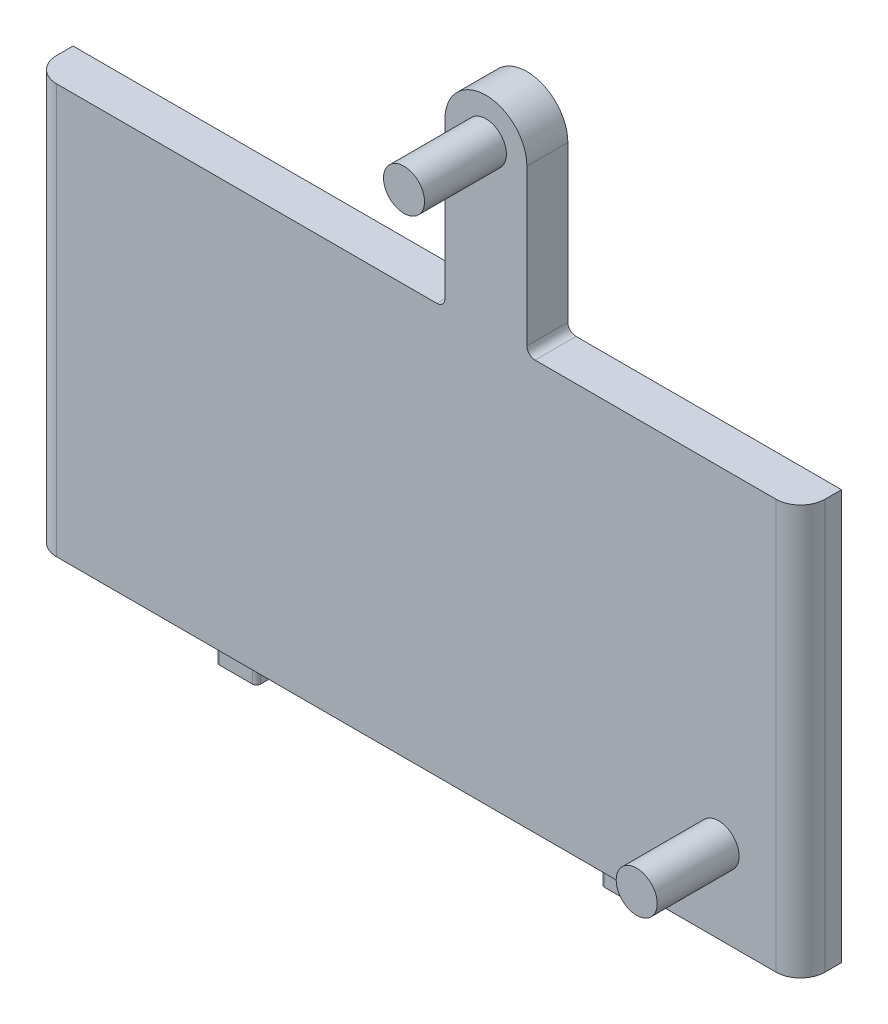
ISO-10303-21;
HEADER;
FILE_DESCRIPTION(('STEP AP214'),'2;1');
FILE_NAME('part.step','',(''),(''),'','','');
FILE_SCHEMA(('AUTOMOTIVE_DESIGN { 1 0 10303 214 1 1 1 1 }'));
ENDSEC;
DATA;
#1=APPLICATION_CONTEXT('core data for automotive mechanical design processes');
#2=APPLICATION_PROTOCOL_DEFINITION('international standard','automotive_design',2000,#1);
#3=PRODUCT_CONTEXT('',#1,'mechanical');
#4=PRODUCT('Part','Part','',(#3));
#5=PRODUCT_RELATED_PRODUCT_CATEGORY('part','',(#4));
#6=PRODUCT_DEFINITION_FORMATION('','',#4);
#7=PRODUCT_DEFINITION_CONTEXT('part definition',#1,'design');
#8=PRODUCT_DEFINITION('design','',#6,#7);
#9=PRODUCT_DEFINITION_SHAPE('','',#8);
#10=(LENGTH_UNIT() NAMED_UNIT(*) SI_UNIT(.MILLI.,.METRE.));
#11=(NAMED_UNIT(*) PLANE_ANGLE_UNIT() SI_UNIT($,.RADIAN.));
#12=(NAMED_UNIT(*) SI_UNIT($,.STERADIAN.) SOLID_ANGLE_UNIT());
#13=UNCERTAINTY_MEASURE_WITH_UNIT(LENGTH_MEASURE(1.E-05),#10,'distance_accuracy_value','');
#14=(GEOMETRIC_REPRESENTATION_CONTEXT(3) GLOBAL_UNCERTAINTY_ASSIGNED_CONTEXT((#13)) GLOBAL_UNIT_ASSIGNED_CONTEXT((#10,
#11,#12)) REPRESENTATION_CONTEXT('',''));
#15=CARTESIAN_POINT('',(0.,0.,0.));
#16=DIRECTION('',(0.,0.,1.));
#17=DIRECTION('',(1.,0.,0.));
#18=AXIS2_PLACEMENT_3D('',#15,#16,#17);
#19=CARTESIAN_POINT('',(0.,0.,5.));
#20=DIRECTION('',(0.,0.,-1.));
#21=DIRECTION('',(-1.,0.,0.));
#22=AXIS2_PLACEMENT_3D('',#19,#20,#21);
#23=PLANE('',#22);
#24=CARTESIAN_POINT('',(8.49999999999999,45.,5.));
#25=DIRECTION('',(0.,0.,-1.));
#26=DIRECTION('',(-1.,0.,0.));
#27=AXIS2_PLACEMENT_3D('',#24,#25,#26);
#28=CIRCLE('',#27,2.5);
#29=CARTESIAN_POINT('',(5.99999999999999,45.,5.));
#30=VERTEX_POINT('',#29);
#31=EDGE_CURVE('E509',#30,#30,#28,.F.);
#32=ORIENTED_EDGE('',*,*,#31,.F.);
#33=EDGE_LOOP('',(#32));
#34=FACE_BOUND('',#33,.T.);
#35=DIRECTION('',(-1.,0.,0.));
#36=VECTOR('',#35,1.);
#37=CARTESIAN_POINT('',(-46.9,25.,5.));
#38=LINE('',#37,#36);
#39=CARTESIAN_POINT('',(43.9,25.,5.));
#40=VERTEX_POINT('',#39);
#41=CARTESIAN_POINT('',(14.5,25.,5.));
#42=VERTEX_POINT('',#41);
#43=EDGE_CURVE('E397',#40,#42,#38,.T.);
#44=ORIENTED_EDGE('',*,*,#43,.T.);
#45=CARTESIAN_POINT('',(14.5,26.,5.));
#46=DIRECTION('',(0.,0.,-1.));
#47=DIRECTION('',(-1.,0.,0.));
#48=AXIS2_PLACEMENT_3D('',#45,#46,#47);
#49=CIRCLE('',#48,1.);
#50=CARTESIAN_POINT('',(13.5,26.,5.));
#51=VERTEX_POINT('',#50);
#52=EDGE_CURVE('E229',#42,#51,#49,.T.);
#53=ORIENTED_EDGE('',*,*,#52,.T.);
#54=DIRECTION('',(0.,1.,0.));
#55=VECTOR('',#54,1.);
#56=CARTESIAN_POINT('',(13.5,45.,5.));
#57=LINE('',#56,#55);
#58=CARTESIAN_POINT('',(13.5,45.,5.));
#59=VERTEX_POINT('',#58);
#60=EDGE_CURVE('E221',#51,#59,#57,.T.);
#61=ORIENTED_EDGE('',*,*,#60,.T.);
#62=CARTESIAN_POINT('',(8.49999999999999,45.,5.));
#63=DIRECTION('',(0.,0.,1.));
#64=DIRECTION('',(-1.,0.,0.));
#65=AXIS2_PLACEMENT_3D('',#62,#63,#64);
#66=CIRCLE('',#65,5.);
#67=CARTESIAN_POINT('',(3.5,45.,5.));
#68=VERTEX_POINT('',#67);
#69=EDGE_CURVE('E226',#59,#68,#66,.T.);
#70=ORIENTED_EDGE('',*,*,#69,.T.);
#71=DIRECTION('',(0.,-1.,0.));
#72=VECTOR('',#71,1.);
#73=CARTESIAN_POINT('',(3.5,25.,5.));
#74=LINE('',#73,#72);
#75=CARTESIAN_POINT('',(3.5,26.,5.));
#76=VERTEX_POINT('',#75);
#77=EDGE_CURVE('E247',#68,#76,#74,.T.);
#78=ORIENTED_EDGE('',*,*,#77,.T.);
#79=CARTESIAN_POINT('',(2.5,26.,5.));
#80=DIRECTION('',(0.,0.,-1.));
#81=DIRECTION('',(-1.,0.,0.));
#82=AXIS2_PLACEMENT_3D('',#79,#80,#81);
#83=CIRCLE('',#82,1.);
#84=CARTESIAN_POINT('',(2.5,25.,5.));
#85=VERTEX_POINT('',#84);
#86=EDGE_CURVE('E43',#76,#85,#83,.T.);
#87=ORIENTED_EDGE('',*,*,#86,.T.);
#88=CARTESIAN_POINT('',(-43.9,25.,5.));
#89=VERTEX_POINT('',#88);
#90=EDGE_CURVE('E393',#85,#89,#38,.T.);
#91=ORIENTED_EDGE('',*,*,#90,.T.);
#92=DIRECTION('',(0.,-1.,0.));
#93=VECTOR('',#92,1.);
#94=CARTESIAN_POINT('',(-43.9,0.,5.));
#95=LINE('',#94,#93);
#96=CARTESIAN_POINT('',(-43.9,-25.,5.));
#97=VERTEX_POINT('',#96);
#98=EDGE_CURVE('E500',#89,#97,#95,.T.);
#99=ORIENTED_EDGE('',*,*,#98,.T.);
#100=DIRECTION('',(1.,0.,0.));
#101=VECTOR('',#100,1.);
#102=CARTESIAN_POINT('',(-46.9,-25.,5.));
#103=LINE('',#102,#101);
#104=CARTESIAN_POINT('',(43.9,-25.,5.));
#105=VERTEX_POINT('',#104);
#106=EDGE_CURVE('E389',#97,#105,#103,.T.);
#107=ORIENTED_EDGE('',*,*,#106,.T.);
#108=DIRECTION('',(0.,1.,0.));
#109=VECTOR('',#108,1.);
#110=CARTESIAN_POINT('',(43.9,0.,5.));
#111=LINE('',#110,#109);
#112=EDGE_CURVE('E494',#105,#40,#111,.T.);
#113=ORIENTED_EDGE('',*,*,#112,.T.);
#114=EDGE_LOOP('',(#44,#53,#61,#70,#78,#87,#91,#99,#107,#113));
#115=FACE_BOUND('',#114,.T.);
#116=CARTESIAN_POINT('',(36.9,-15.,5.));
#117=DIRECTION('',(0.,0.,-1.));
#118=DIRECTION('',(-1.,0.,0.));
#119=AXIS2_PLACEMENT_3D('',#116,#117,#118);
#120=CIRCLE('',#119,2.5);
#121=CARTESIAN_POINT('',(34.4,-15.,5.));
#122=VERTEX_POINT('',#121);
#123=EDGE_CURVE('E11',#122,#122,#120,.F.);
#124=ORIENTED_EDGE('',*,*,#123,.F.);
#125=EDGE_LOOP('',(#124));
#126=FACE_BOUND('',#125,.T.);
#127=ADVANCED_FACE('F35',(#34,#115,#126),#23,.F.);
#128=CARTESIAN_POINT('',(-46.9,25.,5.));
#129=DIRECTION('',(0.,-1.,0.));
#130=DIRECTION('',(0.,0.,-1.));
#131=AXIS2_PLACEMENT_3D('',#128,#129,#130);
#132=PLANE('',#131);
#133=DIRECTION('',(-1.,0.,0.));
#134=VECTOR('',#133,1.);
#135=CARTESIAN_POINT('',(-46.9,25.,0.));
#136=LINE('',#135,#134);
#137=CARTESIAN_POINT('',(46.9,25.,0.));
#138=VERTEX_POINT('',#137);
#139=CARTESIAN_POINT('',(14.5,25.,0.));
#140=VERTEX_POINT('',#139);
#141=EDGE_CURVE('E402',#138,#140,#136,.T.);
#142=ORIENTED_EDGE('',*,*,#141,.T.);
#143=DIRECTION('',(0.,0.,-1.));
#144=VECTOR('',#143,1.);
#145=CARTESIAN_POINT('',(14.5,25.,5.));
#146=LINE('',#145,#144);
#147=EDGE_CURVE('E417',#140,#42,#146,.F.);
#148=ORIENTED_EDGE('',*,*,#147,.T.);
#149=ORIENTED_EDGE('',*,*,#43,.F.);
#150=CARTESIAN_POINT('',(43.9,25.,2.));
#151=DIRECTION('',(0.,-1.,0.));
#152=DIRECTION('',(0.,0.,-1.));
#153=AXIS2_PLACEMENT_3D('',#150,#151,#152);
#154=CIRCLE('',#153,3.);
#155=CARTESIAN_POINT('',(46.9,25.,2.));
#156=VERTEX_POINT('',#155);
#157=EDGE_CURVE('E508',#40,#156,#154,.F.);
#158=ORIENTED_EDGE('',*,*,#157,.T.);
#159=DIRECTION('',(0.,0.,-1.));
#160=VECTOR('',#159,1.);
#161=CARTESIAN_POINT('',(46.9,25.,5.));
#162=LINE('',#161,#160);
#163=EDGE_CURVE('E652',#156,#138,#162,.T.);
#164=ORIENTED_EDGE('',*,*,#163,.T.);
#165=EDGE_LOOP('',(#142,#148,#149,#158,#164));
#166=FACE_BOUND('',#165,.T.);
#167=ADVANCED_FACE('F448',(#166),#132,.F.);
#168=CARTESIAN_POINT('',(-46.9,-25.,5.));
#169=DIRECTION('',(0.,1.,0.));
#170=DIRECTION('',(0.,0.,1.));
#171=AXIS2_PLACEMENT_3D('',#168,#169,#170);
#172=PLANE('',#171);
#173=CARTESIAN_POINT('',(-21.5,-25.,3.));
#174=DIRECTION('',(0.,-1.,0.));
#175=DIRECTION('',(0.,0.,1.));
#176=AXIS2_PLACEMENT_3D('',#173,#174,#175);
#177=CIRCLE('',#176,0.5);
#178=CARTESIAN_POINT('',(-21.,-25.,3.));
#179=VERTEX_POINT('',#178);
#180=CARTESIAN_POINT('',(-21.5,-25.,3.5));
#181=VERTEX_POINT('',#180);
#182=EDGE_CURVE('E321',#179,#181,#177,.T.);
#183=ORIENTED_EDGE('',*,*,#182,.F.);
#184=DIRECTION('',(0.,0.,1.));
#185=VECTOR('',#184,1.);
#186=CARTESIAN_POINT('',(-21.,-25.,3.));
#187=LINE('',#186,#185);
#188=CARTESIAN_POINT('',(-21.,-25.,2.));
#189=VERTEX_POINT('',#188);
#190=EDGE_CURVE('E326',#189,#179,#187,.T.);
#191=ORIENTED_EDGE('',*,*,#190,.F.);
#192=CARTESIAN_POINT('',(-21.5,-25.,2.));
#193=DIRECTION('',(0.,-1.,0.));
#194=DIRECTION('',(0.,0.,-1.));
#195=AXIS2_PLACEMENT_3D('',#192,#193,#194);
#196=CIRCLE('',#195,0.5);
#197=CARTESIAN_POINT('',(-21.5,-25.,1.5));
#198=VERTEX_POINT('',#197);
#199=EDGE_CURVE('E358',#198,#189,#196,.T.);
#200=ORIENTED_EDGE('',*,*,#199,.F.);
#201=DIRECTION('',(1.,0.,0.));
#202=VECTOR('',#201,1.);
#203=CARTESIAN_POINT('',(-25.5,-25.,1.5));
#204=LINE('',#203,#202);
#205=CARTESIAN_POINT('',(-25.5,-25.,1.5));
#206=VERTEX_POINT('',#205);
#207=EDGE_CURVE('E355',#206,#198,#204,.T.);
#208=ORIENTED_EDGE('',*,*,#207,.F.);
#209=CARTESIAN_POINT('',(-25.5,-25.,2.));
#210=DIRECTION('',(0.,-1.,0.));
#211=DIRECTION('',(0.,0.,-1.));
#212=AXIS2_PLACEMENT_3D('',#209,#210,#211);
#213=CIRCLE('',#212,0.5);
#214=CARTESIAN_POINT('',(-26.,-25.,2.));
#215=VERTEX_POINT('',#214);
#216=EDGE_CURVE('E352',#215,#206,#213,.T.);
#217=ORIENTED_EDGE('',*,*,#216,.F.);
#218=DIRECTION('',(0.,0.,-1.));
#219=VECTOR('',#218,1.);
#220=CARTESIAN_POINT('',(-26.,-25.,3.));
#221=LINE('',#220,#219);
#222=CARTESIAN_POINT('',(-26.,-25.,3.));
#223=VERTEX_POINT('',#222);
#224=EDGE_CURVE('E349',#223,#215,#221,.T.);
#225=ORIENTED_EDGE('',*,*,#224,.F.);
#226=CARTESIAN_POINT('',(-25.5,-25.,3.));
#227=DIRECTION('',(0.,-1.,0.));
#228=DIRECTION('',(0.,0.,-1.));
#229=AXIS2_PLACEMENT_3D('',#226,#227,#228);
#230=CIRCLE('',#229,0.5);
#231=CARTESIAN_POINT('',(-25.5,-25.,3.5));
#232=VERTEX_POINT('',#231);
#233=EDGE_CURVE('E346',#232,#223,#230,.T.);
#234=ORIENTED_EDGE('',*,*,#233,.F.);
#235=DIRECTION('',(-1.,0.,0.));
#236=VECTOR('',#235,1.);
#237=CARTESIAN_POINT('',(-25.5,-25.,3.5));
#238=LINE('',#237,#236);
#239=EDGE_CURVE('E343',#181,#232,#238,.T.);
#240=ORIENTED_EDGE('',*,*,#239,.F.);
#241=EDGE_LOOP('',(#183,#191,#200,#208,#217,#225,#234,#240));
#242=FACE_BOUND('',#241,.T.);
#243=ORIENTED_EDGE('',*,*,#106,.F.);
#244=CARTESIAN_POINT('',(-43.9,-25.,2.));
#245=DIRECTION('',(0.,1.,0.));
#246=DIRECTION('',(0.,0.,1.));
#247=AXIS2_PLACEMENT_3D('',#244,#245,#246);
#248=CIRCLE('',#247,3.);
#249=CARTESIAN_POINT('',(-46.9,-25.,2.));
#250=VERTEX_POINT('',#249);
#251=EDGE_CURVE('E499',#97,#250,#248,.F.);
#252=ORIENTED_EDGE('',*,*,#251,.T.);
#253=DIRECTION('',(0.,0.,-1.));
#254=VECTOR('',#253,1.);
#255=CARTESIAN_POINT('',(-46.9,-25.,5.));
#256=LINE('',#255,#254);
#257=CARTESIAN_POINT('',(-46.9,-25.,0.));
#258=VERTEX_POINT('',#257);
#259=EDGE_CURVE('E643',#250,#258,#256,.T.);
#260=ORIENTED_EDGE('',*,*,#259,.T.);
#261=DIRECTION('',(1.,0.,0.));
#262=VECTOR('',#261,1.);
#263=CARTESIAN_POINT('',(-46.9,-25.,0.));
#264=LINE('',#263,#262);
#265=CARTESIAN_POINT('',(46.9,-25.,0.));
#266=VERTEX_POINT('',#265);
#267=EDGE_CURVE('E434',#258,#266,#264,.T.);
#268=ORIENTED_EDGE('',*,*,#267,.T.);
#269=DIRECTION('',(0.,0.,-1.));
#270=VECTOR('',#269,1.);
#271=CARTESIAN_POINT('',(46.9,-25.,5.));
#272=LINE('',#271,#270);
#273=CARTESIAN_POINT('',(46.9,-25.,2.));
#274=VERTEX_POINT('',#273);
#275=EDGE_CURVE('E642',#274,#266,#272,.T.);
#276=ORIENTED_EDGE('',*,*,#275,.F.);
#277=CARTESIAN_POINT('',(43.9,-25.,2.));
#278=DIRECTION('',(0.,1.,0.));
#279=DIRECTION('',(0.,0.,1.));
#280=AXIS2_PLACEMENT_3D('',#277,#278,#279);
#281=CIRCLE('',#280,3.);
#282=EDGE_CURVE('E492',#274,#105,#281,.F.);
#283=ORIENTED_EDGE('',*,*,#282,.T.);
#284=EDGE_LOOP('',(#243,#252,#260,#268,#276,#283));
#285=FACE_BOUND('',#284,.T.);
#286=CARTESIAN_POINT('',(25.5,-25.,3.00000000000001));
#287=DIRECTION('',(0.,-1.,0.));
#288=DIRECTION('',(0.,0.,1.));
#289=AXIS2_PLACEMENT_3D('',#286,#287,#288);
#290=CIRCLE('',#289,0.5);
#291=CARTESIAN_POINT('',(26.,-25.,3.00000000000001));
#292=VERTEX_POINT('',#291);
#293=CARTESIAN_POINT('',(25.5,-25.,3.50000000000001));
#294=VERTEX_POINT('',#293);
#295=EDGE_CURVE('E242',#292,#294,#290,.T.);
#296=ORIENTED_EDGE('',*,*,#295,.F.);
#297=DIRECTION('',(0.,0.,1.));
#298=VECTOR('',#297,1.);
#299=CARTESIAN_POINT('',(26.,-25.,3.00000000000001));
#300=LINE('',#299,#298);
#301=CARTESIAN_POINT('',(26.,-25.,2.00000000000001));
#302=VERTEX_POINT('',#301);
#303=EDGE_CURVE('E261',#302,#292,#300,.T.);
#304=ORIENTED_EDGE('',*,*,#303,.F.);
#305=CARTESIAN_POINT('',(25.5,-25.,2.00000000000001));
#306=DIRECTION('',(0.,-1.,0.));
#307=DIRECTION('',(0.,0.,1.));
#308=AXIS2_PLACEMENT_3D('',#305,#306,#307);
#309=CIRCLE('',#308,0.5);
#310=CARTESIAN_POINT('',(25.5,-25.,1.50000000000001));
#311=VERTEX_POINT('',#310);
#312=EDGE_CURVE('E293',#311,#302,#309,.T.);
#313=ORIENTED_EDGE('',*,*,#312,.F.);
#314=DIRECTION('',(1.,0.,0.));
#315=VECTOR('',#314,1.);
#316=CARTESIAN_POINT('',(25.5,-25.,1.50000000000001));
#317=LINE('',#316,#315);
#318=CARTESIAN_POINT('',(21.5,-25.,1.50000000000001));
#319=VERTEX_POINT('',#318);
#320=EDGE_CURVE('E290',#319,#311,#317,.T.);
#321=ORIENTED_EDGE('',*,*,#320,.F.);
#322=CARTESIAN_POINT('',(21.5,-25.,2.00000000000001));
#323=DIRECTION('',(0.,-1.,0.));
#324=DIRECTION('',(0.,0.,1.));
#325=AXIS2_PLACEMENT_3D('',#322,#323,#324);
#326=CIRCLE('',#325,0.5);
#327=CARTESIAN_POINT('',(21.,-25.,2.00000000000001));
#328=VERTEX_POINT('',#327);
#329=EDGE_CURVE('E287',#328,#319,#326,.T.);
#330=ORIENTED_EDGE('',*,*,#329,.F.);
#331=DIRECTION('',(0.,0.,-1.));
#332=VECTOR('',#331,1.);
#333=CARTESIAN_POINT('',(21.,-25.,3.00000000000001));
#334=LINE('',#333,#332);
#335=CARTESIAN_POINT('',(21.,-25.,3.00000000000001));
#336=VERTEX_POINT('',#335);
#337=EDGE_CURVE('E284',#336,#328,#334,.T.);
#338=ORIENTED_EDGE('',*,*,#337,.F.);
#339=CARTESIAN_POINT('',(21.5,-25.,3.00000000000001));
#340=DIRECTION('',(0.,-1.,0.));
#341=DIRECTION('',(0.,0.,-1.));
#342=AXIS2_PLACEMENT_3D('',#339,#340,#341);
#343=CIRCLE('',#342,0.5);
#344=CARTESIAN_POINT('',(21.5,-25.,3.50000000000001));
#345=VERTEX_POINT('',#344);
#346=EDGE_CURVE('E281',#345,#336,#343,.T.);
#347=ORIENTED_EDGE('',*,*,#346,.F.);
#348=DIRECTION('',(-1.,0.,0.));
#349=VECTOR('',#348,1.);
#350=CARTESIAN_POINT('',(25.5,-25.,3.50000000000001));
#351=LINE('',#350,#349);
#352=EDGE_CURVE('E278',#294,#345,#351,.T.);
#353=ORIENTED_EDGE('',*,*,#352,.F.);
#354=EDGE_LOOP('',(#296,#304,#313,#321,#330,#338,#347,#353));
#355=FACE_BOUND('',#354,.T.);
#356=ADVANCED_FACE('F454',(#242,#285,#355),#172,.F.);
#357=CARTESIAN_POINT('',(46.9,-25.,5.));
#358=DIRECTION('',(-1.,0.,0.));
#359=DIRECTION('',(0.,0.,1.));
#360=AXIS2_PLACEMENT_3D('',#357,#358,#359);
#361=PLANE('',#360);
#362=ORIENTED_EDGE('',*,*,#163,.F.);
#363=DIRECTION('',(0.,1.,0.));
#364=VECTOR('',#363,1.);
#365=CARTESIAN_POINT('',(46.9,-25.,2.));
#366=LINE('',#365,#364);
#367=EDGE_CURVE('E400',#156,#274,#366,.F.);
#368=ORIENTED_EDGE('',*,*,#367,.T.);
#369=ORIENTED_EDGE('',*,*,#275,.T.);
#370=DIRECTION('',(0.,1.,0.));
#371=VECTOR('',#370,1.);
#372=CARTESIAN_POINT('',(46.9,-25.,0.));
#373=LINE('',#372,#371);
#374=EDGE_CURVE('E386',#266,#138,#373,.T.);
#375=ORIENTED_EDGE('',*,*,#374,.T.);
#376=EDGE_LOOP('',(#362,#368,#369,#375));
#377=FACE_BOUND('',#376,.T.);
#378=ADVANCED_FACE('F469',(#377),#361,.F.);
#379=ORIENTED_EDGE('',*,*,#90,.F.);
#380=DIRECTION('',(0.,0.,-1.));
#381=VECTOR('',#380,1.);
#382=CARTESIAN_POINT('',(2.5,25.,0.));
#383=LINE('',#382,#381);
#384=CARTESIAN_POINT('',(2.5,25.,0.));
#385=VERTEX_POINT('',#384);
#386=EDGE_CURVE('E414',#85,#385,#383,.T.);
#387=ORIENTED_EDGE('',*,*,#386,.T.);
#388=CARTESIAN_POINT('',(-46.9,25.,0.));
#389=VERTEX_POINT('',#388);
#390=EDGE_CURVE('E407',#385,#389,#136,.T.);
#391=ORIENTED_EDGE('',*,*,#390,.T.);
#392=DIRECTION('',(0.,0.,-1.));
#393=VECTOR('',#392,1.);
#394=CARTESIAN_POINT('',(-46.9,25.,5.));
#395=LINE('',#394,#393);
#396=CARTESIAN_POINT('',(-46.9,25.,2.));
#397=VERTEX_POINT('',#396);
#398=EDGE_CURVE('E647',#397,#389,#395,.T.);
#399=ORIENTED_EDGE('',*,*,#398,.F.);
#400=CARTESIAN_POINT('',(-43.9,25.,2.));
#401=DIRECTION('',(0.,-1.,0.));
#402=DIRECTION('',(0.,0.,-1.));
#403=AXIS2_PLACEMENT_3D('',#400,#401,#402);
#404=CIRCLE('',#403,3.);
#405=EDGE_CURVE('E432',#397,#89,#404,.F.);
#406=ORIENTED_EDGE('',*,*,#405,.T.);
#407=EDGE_LOOP('',(#379,#387,#391,#399,#406));
#408=FACE_BOUND('',#407,.T.);
#409=ADVANCED_FACE('F429',(#408),#132,.F.);
#410=CARTESIAN_POINT('',(-46.9,-25.,5.));
#411=DIRECTION('',(1.,0.,0.));
#412=DIRECTION('',(0.,0.,-1.));
#413=AXIS2_PLACEMENT_3D('',#410,#411,#412);
#414=PLANE('',#413);
#415=ORIENTED_EDGE('',*,*,#259,.F.);
#416=DIRECTION('',(0.,-1.,0.));
#417=VECTOR('',#416,1.);
#418=CARTESIAN_POINT('',(-46.9,-25.,2.));
#419=LINE('',#418,#417);
#420=EDGE_CURVE('E502',#250,#397,#419,.F.);
#421=ORIENTED_EDGE('',*,*,#420,.T.);
#422=ORIENTED_EDGE('',*,*,#398,.T.);
#423=DIRECTION('',(0.,-1.,0.));
#424=VECTOR('',#423,1.);
#425=CARTESIAN_POINT('',(-46.9,-25.,0.));
#426=LINE('',#425,#424);
#427=EDGE_CURVE('E406',#389,#258,#426,.T.);
#428=ORIENTED_EDGE('',*,*,#427,.T.);
#429=EDGE_LOOP('',(#415,#421,#422,#428));
#430=FACE_BOUND('',#429,.T.);
#431=ADVANCED_FACE('F466',(#430),#414,.F.);
#432=CARTESIAN_POINT('',(0.,0.,0.));
#433=DIRECTION('',(0.,0.,-1.));
#434=DIRECTION('',(-1.,0.,0.));
#435=AXIS2_PLACEMENT_3D('',#432,#433,#434);
#436=PLANE('',#435);
#437=ORIENTED_EDGE('',*,*,#374,.F.);
#438=ORIENTED_EDGE('',*,*,#267,.F.);
#439=ORIENTED_EDGE('',*,*,#427,.F.);
#440=ORIENTED_EDGE('',*,*,#390,.F.);
#441=CARTESIAN_POINT('',(2.5,26.,0.));
#442=DIRECTION('',(0.,0.,-1.));
#443=DIRECTION('',(-1.,0.,0.));
#444=AXIS2_PLACEMENT_3D('',#441,#442,#443);
#445=CIRCLE('',#444,1.);
#446=CARTESIAN_POINT('',(3.5,26.,0.));
#447=VERTEX_POINT('',#446);
#448=EDGE_CURVE('E58',#385,#447,#445,.F.);
#449=ORIENTED_EDGE('',*,*,#448,.T.);
#450=DIRECTION('',(0.,-1.,0.));
#451=VECTOR('',#450,1.);
#452=CARTESIAN_POINT('',(3.5,25.,0.));
#453=LINE('',#452,#451);
#454=CARTESIAN_POINT('',(3.5,45.,0.));
#455=VERTEX_POINT('',#454);
#456=EDGE_CURVE('E233',#455,#447,#453,.T.);
#457=ORIENTED_EDGE('',*,*,#456,.F.);
#458=CARTESIAN_POINT('',(8.49999999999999,45.,0.));
#459=DIRECTION('',(0.,0.,1.));
#460=DIRECTION('',(-1.,0.,0.));
#461=AXIS2_PLACEMENT_3D('',#458,#459,#460);
#462=CIRCLE('',#461,5.);
#463=CARTESIAN_POINT('',(13.5,45.,0.));
#464=VERTEX_POINT('',#463);
#465=EDGE_CURVE('E254',#464,#455,#462,.T.);
#466=ORIENTED_EDGE('',*,*,#465,.F.);
#467=DIRECTION('',(0.,1.,0.));
#468=VECTOR('',#467,1.);
#469=CARTESIAN_POINT('',(13.5,45.,0.));
#470=LINE('',#469,#468);
#471=CARTESIAN_POINT('',(13.5,26.,0.));
#472=VERTEX_POINT('',#471);
#473=EDGE_CURVE('E239',#472,#464,#470,.T.);
#474=ORIENTED_EDGE('',*,*,#473,.F.);
#475=CARTESIAN_POINT('',(14.5,26.,0.));
#476=DIRECTION('',(0.,0.,-1.));
#477=DIRECTION('',(-1.,0.,0.));
#478=AXIS2_PLACEMENT_3D('',#475,#476,#477);
#479=CIRCLE('',#478,1.);
#480=EDGE_CURVE('E419',#472,#140,#479,.F.);
#481=ORIENTED_EDGE('',*,*,#480,.T.);
#482=ORIENTED_EDGE('',*,*,#141,.F.);
#483=EDGE_LOOP('',(#437,#438,#439,#440,#449,#457,#466,#474,#481,#482));
#484=FACE_BOUND('',#483,.T.);
#485=ADVANCED_FACE('F462',(#484),#436,.T.);
#486=CARTESIAN_POINT('',(-43.9,0.,2.));
#487=DIRECTION('',(0.,-1.,0.));
#488=DIRECTION('',(0.,0.,-1.));
#489=AXIS2_PLACEMENT_3D('',#486,#487,#488);
#490=CYLINDRICAL_SURFACE('',#489,3.);
#491=ORIENTED_EDGE('',*,*,#405,.F.);
#492=ORIENTED_EDGE('',*,*,#420,.F.);
#493=ORIENTED_EDGE('',*,*,#251,.F.);
#494=ORIENTED_EDGE('',*,*,#98,.F.);
#495=EDGE_LOOP('',(#491,#492,#493,#494));
#496=FACE_BOUND('',#495,.T.);
#497=ADVANCED_FACE('F465',(#496),#490,.T.);
#498=CARTESIAN_POINT('',(43.9,0.,2.));
#499=DIRECTION('',(0.,1.,0.));
#500=DIRECTION('',(0.,0.,1.));
#501=AXIS2_PLACEMENT_3D('',#498,#499,#500);
#502=CYLINDRICAL_SURFACE('',#501,3.);
#503=ORIENTED_EDGE('',*,*,#282,.F.);
#504=ORIENTED_EDGE('',*,*,#367,.F.);
#505=ORIENTED_EDGE('',*,*,#157,.F.);
#506=ORIENTED_EDGE('',*,*,#112,.F.);
#507=EDGE_LOOP('',(#503,#504,#505,#506));
#508=FACE_BOUND('',#507,.T.);
#509=ADVANCED_FACE('F480',(#508),#502,.T.);
#510=CARTESIAN_POINT('',(-21.5,-28.,3.));
#511=DIRECTION('',(0.,1.,0.));
#512=DIRECTION('',(0.,0.,1.));
#513=AXIS2_PLACEMENT_3D('',#510,#511,#512);
#514=CYLINDRICAL_SURFACE('',#513,0.5);
#515=ORIENTED_EDGE('',*,*,#182,.T.);
#516=DIRECTION('',(0.,1.,0.));
#517=VECTOR('',#516,1.);
#518=CARTESIAN_POINT('',(-21.5,-28.,3.5));
#519=LINE('',#518,#517);
#520=CARTESIAN_POINT('',(-21.5,-28.,3.5));
#521=VERTEX_POINT('',#520);
#522=EDGE_CURVE('E383',#521,#181,#519,.T.);
#523=ORIENTED_EDGE('',*,*,#522,.F.);
#524=CARTESIAN_POINT('',(-21.5,-28.,3.));
#525=DIRECTION('',(0.,-1.,0.));
#526=DIRECTION('',(0.,0.,1.));
#527=AXIS2_PLACEMENT_3D('',#524,#525,#526);
#528=CIRCLE('',#527,0.5);
#529=CARTESIAN_POINT('',(-21.,-28.,3.));
#530=VERTEX_POINT('',#529);
#531=EDGE_CURVE('E322',#530,#521,#528,.T.);
#532=ORIENTED_EDGE('',*,*,#531,.F.);
#533=DIRECTION('',(0.,1.,0.));
#534=VECTOR('',#533,1.);
#535=CARTESIAN_POINT('',(-21.,-28.,3.));
#536=LINE('',#535,#534);
#537=EDGE_CURVE('E340',#530,#179,#536,.T.);
#538=ORIENTED_EDGE('',*,*,#537,.T.);
#539=EDGE_LOOP('',(#515,#523,#532,#538));
#540=FACE_BOUND('',#539,.T.);
#541=ADVANCED_FACE('F460',(#540),#514,.T.);
#542=CARTESIAN_POINT('',(-25.5,-28.,3.5));
#543=DIRECTION('',(0.,0.,-1.));
#544=DIRECTION('',(-1.,0.,0.));
#545=AXIS2_PLACEMENT_3D('',#542,#543,#544);
#546=PLANE('',#545);
#547=ORIENTED_EDGE('',*,*,#239,.T.);
#548=DIRECTION('',(0.,1.,0.));
#549=VECTOR('',#548,1.);
#550=CARTESIAN_POINT('',(-25.5,-28.,3.5));
#551=LINE('',#550,#549);
#552=CARTESIAN_POINT('',(-25.5,-28.,3.5));
#553=VERTEX_POINT('',#552);
#554=EDGE_CURVE('E380',#553,#232,#551,.T.);
#555=ORIENTED_EDGE('',*,*,#554,.F.);
#556=DIRECTION('',(-1.,0.,0.));
#557=VECTOR('',#556,1.);
#558=CARTESIAN_POINT('',(-25.5,-28.,3.5));
#559=LINE('',#558,#557);
#560=EDGE_CURVE('E325',#521,#553,#559,.T.);
#561=ORIENTED_EDGE('',*,*,#560,.F.);
#562=ORIENTED_EDGE('',*,*,#522,.T.);
#563=EDGE_LOOP('',(#547,#555,#561,#562));
#564=FACE_BOUND('',#563,.T.);
#565=ADVANCED_FACE('F487',(#564),#546,.F.);
#566=CARTESIAN_POINT('',(-25.5,-28.,3.));
#567=DIRECTION('',(0.,1.,0.));
#568=DIRECTION('',(0.,0.,1.));
#569=AXIS2_PLACEMENT_3D('',#566,#567,#568);
#570=CYLINDRICAL_SURFACE('',#569,0.5);
#571=ORIENTED_EDGE('',*,*,#233,.T.);
#572=DIRECTION('',(0.,1.,0.));
#573=VECTOR('',#572,1.);
#574=CARTESIAN_POINT('',(-26.,-28.,3.));
#575=LINE('',#574,#573);
#576=CARTESIAN_POINT('',(-26.,-28.,3.));
#577=VERTEX_POINT('',#576);
#578=EDGE_CURVE('E377',#577,#223,#575,.T.);
#579=ORIENTED_EDGE('',*,*,#578,.F.);
#580=CARTESIAN_POINT('',(-25.5,-28.,3.));
#581=DIRECTION('',(0.,-1.,0.));
#582=DIRECTION('',(0.,0.,-1.));
#583=AXIS2_PLACEMENT_3D('',#580,#581,#582);
#584=CIRCLE('',#583,0.5);
#585=EDGE_CURVE('E328',#553,#577,#584,.T.);
#586=ORIENTED_EDGE('',*,*,#585,.F.);
#587=ORIENTED_EDGE('',*,*,#554,.T.);
#588=EDGE_LOOP('',(#571,#579,#586,#587));
#589=FACE_BOUND('',#588,.T.);
#590=ADVANCED_FACE('F602',(#589),#570,.T.);
#591=CARTESIAN_POINT('',(-26.,-28.,3.));
#592=DIRECTION('',(1.,0.,0.));
#593=DIRECTION('',(0.,0.,-1.));
#594=AXIS2_PLACEMENT_3D('',#591,#592,#593);
#595=PLANE('',#594);
#596=ORIENTED_EDGE('',*,*,#224,.T.);
#597=DIRECTION('',(0.,1.,0.));
#598=VECTOR('',#597,1.);
#599=CARTESIAN_POINT('',(-26.,-28.,2.));
#600=LINE('',#599,#598);
#601=CARTESIAN_POINT('',(-26.,-28.,2.));
#602=VERTEX_POINT('',#601);
#603=EDGE_CURVE('E374',#602,#215,#600,.T.);
#604=ORIENTED_EDGE('',*,*,#603,.F.);
#605=DIRECTION('',(0.,0.,-1.));
#606=VECTOR('',#605,1.);
#607=CARTESIAN_POINT('',(-26.,-28.,3.));
#608=LINE('',#607,#606);
#609=EDGE_CURVE('E330',#577,#602,#608,.T.);
#610=ORIENTED_EDGE('',*,*,#609,.F.);
#611=ORIENTED_EDGE('',*,*,#578,.T.);
#612=EDGE_LOOP('',(#596,#604,#610,#611));
#613=FACE_BOUND('',#612,.T.);
#614=ADVANCED_FACE('F598',(#613),#595,.F.);
#615=CARTESIAN_POINT('',(-25.5,-28.,2.));
#616=DIRECTION('',(0.,1.,0.));
#617=DIRECTION('',(0.,0.,1.));
#618=AXIS2_PLACEMENT_3D('',#615,#616,#617);
#619=CYLINDRICAL_SURFACE('',#618,0.5);
#620=ORIENTED_EDGE('',*,*,#216,.T.);
#621=DIRECTION('',(0.,1.,0.));
#622=VECTOR('',#621,1.);
#623=CARTESIAN_POINT('',(-25.5,-28.,1.5));
#624=LINE('',#623,#622);
#625=CARTESIAN_POINT('',(-25.5,-28.,1.5));
#626=VERTEX_POINT('',#625);
#627=EDGE_CURVE('E371',#626,#206,#624,.T.);
#628=ORIENTED_EDGE('',*,*,#627,.F.);
#629=CARTESIAN_POINT('',(-25.5,-28.,2.));
#630=DIRECTION('',(0.,-1.,0.));
#631=DIRECTION('',(0.,0.,-1.));
#632=AXIS2_PLACEMENT_3D('',#629,#630,#631);
#633=CIRCLE('',#632,0.5);
#634=EDGE_CURVE('E332',#602,#626,#633,.T.);
#635=ORIENTED_EDGE('',*,*,#634,.F.);
#636=ORIENTED_EDGE('',*,*,#603,.T.);
#637=EDGE_LOOP('',(#620,#628,#635,#636));
#638=FACE_BOUND('',#637,.T.);
#639=ADVANCED_FACE('F594',(#638),#619,.T.);
#640=CARTESIAN_POINT('',(-25.5,-28.,1.5));
#641=DIRECTION('',(0.,0.,1.));
#642=DIRECTION('',(1.,0.,0.));
#643=AXIS2_PLACEMENT_3D('',#640,#641,#642);
#644=PLANE('',#643);
#645=ORIENTED_EDGE('',*,*,#207,.T.);
#646=DIRECTION('',(0.,1.,0.));
#647=VECTOR('',#646,1.);
#648=CARTESIAN_POINT('',(-21.5,-28.,1.5));
#649=LINE('',#648,#647);
#650=CARTESIAN_POINT('',(-21.5,-28.,1.5));
#651=VERTEX_POINT('',#650);
#652=EDGE_CURVE('E368',#651,#198,#649,.T.);
#653=ORIENTED_EDGE('',*,*,#652,.F.);
#654=DIRECTION('',(1.,0.,0.));
#655=VECTOR('',#654,1.);
#656=CARTESIAN_POINT('',(-25.5,-28.,1.5));
#657=LINE('',#656,#655);
#658=EDGE_CURVE('E334',#626,#651,#657,.T.);
#659=ORIENTED_EDGE('',*,*,#658,.F.);
#660=ORIENTED_EDGE('',*,*,#627,.T.);
#661=EDGE_LOOP('',(#645,#653,#659,#660));
#662=FACE_BOUND('',#661,.T.);
#663=ADVANCED_FACE('F590',(#662),#644,.F.);
#664=CARTESIAN_POINT('',(-21.5,-28.,2.));
#665=DIRECTION('',(0.,1.,0.));
#666=DIRECTION('',(0.,0.,1.));
#667=AXIS2_PLACEMENT_3D('',#664,#665,#666);
#668=CYLINDRICAL_SURFACE('',#667,0.5);
#669=ORIENTED_EDGE('',*,*,#199,.T.);
#670=DIRECTION('',(0.,1.,0.));
#671=VECTOR('',#670,1.);
#672=CARTESIAN_POINT('',(-21.,-28.,2.));
#673=LINE('',#672,#671);
#674=CARTESIAN_POINT('',(-21.,-28.,2.));
#675=VERTEX_POINT('',#674);
#676=EDGE_CURVE('E365',#675,#189,#673,.T.);
#677=ORIENTED_EDGE('',*,*,#676,.F.);
#678=CARTESIAN_POINT('',(-21.5,-28.,2.));
#679=DIRECTION('',(0.,-1.,0.));
#680=DIRECTION('',(0.,0.,-1.));
#681=AXIS2_PLACEMENT_3D('',#678,#679,#680);
#682=CIRCLE('',#681,0.5);
#683=EDGE_CURVE('E336',#651,#675,#682,.T.);
#684=ORIENTED_EDGE('',*,*,#683,.F.);
#685=ORIENTED_EDGE('',*,*,#652,.T.);
#686=EDGE_LOOP('',(#669,#677,#684,#685));
#687=FACE_BOUND('',#686,.T.);
#688=ADVANCED_FACE('F586',(#687),#668,.T.);
#689=CARTESIAN_POINT('',(-21.,-28.,3.));
#690=DIRECTION('',(-1.,0.,0.));
#691=DIRECTION('',(0.,0.,1.));
#692=AXIS2_PLACEMENT_3D('',#689,#690,#691);
#693=PLANE('',#692);
#694=ORIENTED_EDGE('',*,*,#190,.T.);
#695=ORIENTED_EDGE('',*,*,#537,.F.);
#696=DIRECTION('',(0.,0.,1.));
#697=VECTOR('',#696,1.);
#698=CARTESIAN_POINT('',(-21.,-28.,3.));
#699=LINE('',#698,#697);
#700=EDGE_CURVE('E338',#675,#530,#699,.T.);
#701=ORIENTED_EDGE('',*,*,#700,.F.);
#702=ORIENTED_EDGE('',*,*,#676,.T.);
#703=EDGE_LOOP('',(#694,#695,#701,#702));
#704=FACE_BOUND('',#703,.T.);
#705=ADVANCED_FACE('F582',(#704),#693,.F.);
#706=CARTESIAN_POINT('',(-21.5,-28.,3.));
#707=DIRECTION('',(0.,1.,0.));
#708=DIRECTION('',(0.,0.,1.));
#709=AXIS2_PLACEMENT_3D('',#706,#707,#708);
#710=PLANE('',#709);
#711=ORIENTED_EDGE('',*,*,#531,.T.);
#712=ORIENTED_EDGE('',*,*,#560,.T.);
#713=ORIENTED_EDGE('',*,*,#585,.T.);
#714=ORIENTED_EDGE('',*,*,#609,.T.);
#715=ORIENTED_EDGE('',*,*,#634,.T.);
#716=ORIENTED_EDGE('',*,*,#658,.T.);
#717=ORIENTED_EDGE('',*,*,#683,.T.);
#718=ORIENTED_EDGE('',*,*,#700,.T.);
#719=EDGE_LOOP('',(#711,#712,#713,#714,#715,#716,#717,#718));
#720=FACE_BOUND('',#719,.T.);
#721=ADVANCED_FACE('F578',(#720),#710,.F.);
#722=CARTESIAN_POINT('',(25.5,-28.,3.00000000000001));
#723=DIRECTION('',(0.,1.,0.));
#724=DIRECTION('',(0.,0.,1.));
#725=AXIS2_PLACEMENT_3D('',#722,#723,#724);
#726=CYLINDRICAL_SURFACE('',#725,0.5);
#727=ORIENTED_EDGE('',*,*,#295,.T.);
#728=DIRECTION('',(0.,1.,0.));
#729=VECTOR('',#728,1.);
#730=CARTESIAN_POINT('',(25.5,-28.,3.50000000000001));
#731=LINE('',#730,#729);
#732=CARTESIAN_POINT('',(25.5,-28.,3.50000000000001));
#733=VERTEX_POINT('',#732);
#734=EDGE_CURVE('E318',#733,#294,#731,.T.);
#735=ORIENTED_EDGE('',*,*,#734,.F.);
#736=CARTESIAN_POINT('',(25.5,-28.,3.00000000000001));
#737=DIRECTION('',(0.,-1.,0.));
#738=DIRECTION('',(0.,0.,1.));
#739=AXIS2_PLACEMENT_3D('',#736,#737,#738);
#740=CIRCLE('',#739,0.5);
#741=CARTESIAN_POINT('',(26.,-28.,3.00000000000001));
#742=VERTEX_POINT('',#741);
#743=EDGE_CURVE('E257',#742,#733,#740,.T.);
#744=ORIENTED_EDGE('',*,*,#743,.F.);
#745=DIRECTION('',(0.,1.,0.));
#746=VECTOR('',#745,1.);
#747=CARTESIAN_POINT('',(26.,-28.,3.00000000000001));
#748=LINE('',#747,#746);
#749=EDGE_CURVE('E275',#742,#292,#748,.T.);
#750=ORIENTED_EDGE('',*,*,#749,.T.);
#751=EDGE_LOOP('',(#727,#735,#744,#750));
#752=FACE_BOUND('',#751,.T.);
#753=ADVANCED_FACE('F574',(#752),#726,.T.);
#754=CARTESIAN_POINT('',(25.5,-28.,3.50000000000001));
#755=DIRECTION('',(0.,0.,-1.));
#756=DIRECTION('',(-1.,0.,0.));
#757=AXIS2_PLACEMENT_3D('',#754,#755,#756);
#758=PLANE('',#757);
#759=ORIENTED_EDGE('',*,*,#352,.T.);
#760=DIRECTION('',(0.,1.,0.));
#761=VECTOR('',#760,1.);
#762=CARTESIAN_POINT('',(21.5,-28.,3.50000000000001));
#763=LINE('',#762,#761);
#764=CARTESIAN_POINT('',(21.5,-28.,3.50000000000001));
#765=VERTEX_POINT('',#764);
#766=EDGE_CURVE('E315',#765,#345,#763,.T.);
#767=ORIENTED_EDGE('',*,*,#766,.F.);
#768=DIRECTION('',(-1.,0.,0.));
#769=VECTOR('',#768,1.);
#770=CARTESIAN_POINT('',(25.5,-28.,3.50000000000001));
#771=LINE('',#770,#769);
#772=EDGE_CURVE('E260',#733,#765,#771,.T.);
#773=ORIENTED_EDGE('',*,*,#772,.F.);
#774=ORIENTED_EDGE('',*,*,#734,.T.);
#775=EDGE_LOOP('',(#759,#767,#773,#774));
#776=FACE_BOUND('',#775,.T.);
#777=ADVANCED_FACE('F570',(#776),#758,.F.);
#778=CARTESIAN_POINT('',(21.5,-28.,3.00000000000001));
#779=DIRECTION('',(0.,1.,0.));
#780=DIRECTION('',(0.,0.,1.));
#781=AXIS2_PLACEMENT_3D('',#778,#779,#780);
#782=CYLINDRICAL_SURFACE('',#781,0.5);
#783=ORIENTED_EDGE('',*,*,#346,.T.);
#784=DIRECTION('',(0.,1.,0.));
#785=VECTOR('',#784,1.);
#786=CARTESIAN_POINT('',(21.,-28.,3.00000000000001));
#787=LINE('',#786,#785);
#788=CARTESIAN_POINT('',(21.,-28.,3.00000000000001));
#789=VERTEX_POINT('',#788);
#790=EDGE_CURVE('E312',#789,#336,#787,.T.);
#791=ORIENTED_EDGE('',*,*,#790,.F.);
#792=CARTESIAN_POINT('',(21.5,-28.,3.00000000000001));
#793=DIRECTION('',(0.,-1.,0.));
#794=DIRECTION('',(0.,0.,-1.));
#795=AXIS2_PLACEMENT_3D('',#792,#793,#794);
#796=CIRCLE('',#795,0.5);
#797=EDGE_CURVE('E263',#765,#789,#796,.T.);
#798=ORIENTED_EDGE('',*,*,#797,.F.);
#799=ORIENTED_EDGE('',*,*,#766,.T.);
#800=EDGE_LOOP('',(#783,#791,#798,#799));
#801=FACE_BOUND('',#800,.T.);
#802=ADVANCED_FACE('F566',(#801),#782,.T.);
#803=CARTESIAN_POINT('',(21.,-28.,3.00000000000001));
#804=DIRECTION('',(1.,0.,0.));
#805=DIRECTION('',(0.,0.,-1.));
#806=AXIS2_PLACEMENT_3D('',#803,#804,#805);
#807=PLANE('',#806);
#808=ORIENTED_EDGE('',*,*,#337,.T.);
#809=DIRECTION('',(0.,1.,0.));
#810=VECTOR('',#809,1.);
#811=CARTESIAN_POINT('',(21.,-28.,2.00000000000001));
#812=LINE('',#811,#810);
#813=CARTESIAN_POINT('',(21.,-28.,2.00000000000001));
#814=VERTEX_POINT('',#813);
#815=EDGE_CURVE('E309',#814,#328,#812,.T.);
#816=ORIENTED_EDGE('',*,*,#815,.F.);
#817=DIRECTION('',(0.,0.,-1.));
#818=VECTOR('',#817,1.);
#819=CARTESIAN_POINT('',(21.,-28.,3.00000000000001));
#820=LINE('',#819,#818);
#821=EDGE_CURVE('E265',#789,#814,#820,.T.);
#822=ORIENTED_EDGE('',*,*,#821,.F.);
#823=ORIENTED_EDGE('',*,*,#790,.T.);
#824=EDGE_LOOP('',(#808,#816,#822,#823));
#825=FACE_BOUND('',#824,.T.);
#826=ADVANCED_FACE('F562',(#825),#807,.F.);
#827=CARTESIAN_POINT('',(21.5,-28.,2.00000000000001));
#828=DIRECTION('',(0.,1.,0.));
#829=DIRECTION('',(0.,0.,1.));
#830=AXIS2_PLACEMENT_3D('',#827,#828,#829);
#831=CYLINDRICAL_SURFACE('',#830,0.5);
#832=ORIENTED_EDGE('',*,*,#329,.T.);
#833=DIRECTION('',(0.,1.,0.));
#834=VECTOR('',#833,1.);
#835=CARTESIAN_POINT('',(21.5,-28.,1.50000000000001));
#836=LINE('',#835,#834);
#837=CARTESIAN_POINT('',(21.5,-28.,1.50000000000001));
#838=VERTEX_POINT('',#837);
#839=EDGE_CURVE('E306',#838,#319,#836,.T.);
#840=ORIENTED_EDGE('',*,*,#839,.F.);
#841=CARTESIAN_POINT('',(21.5,-28.,2.00000000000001));
#842=DIRECTION('',(0.,-1.,0.));
#843=DIRECTION('',(0.,0.,1.));
#844=AXIS2_PLACEMENT_3D('',#841,#842,#843);
#845=CIRCLE('',#844,0.5);
#846=EDGE_CURVE('E267',#814,#838,#845,.T.);
#847=ORIENTED_EDGE('',*,*,#846,.F.);
#848=ORIENTED_EDGE('',*,*,#815,.T.);
#849=EDGE_LOOP('',(#832,#840,#847,#848));
#850=FACE_BOUND('',#849,.T.);
#851=ADVANCED_FACE('F558',(#850),#831,.T.);
#852=CARTESIAN_POINT('',(25.5,-28.,1.50000000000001));
#853=DIRECTION('',(0.,0.,1.));
#854=DIRECTION('',(1.,0.,0.));
#855=AXIS2_PLACEMENT_3D('',#852,#853,#854);
#856=PLANE('',#855);
#857=ORIENTED_EDGE('',*,*,#320,.T.);
#858=DIRECTION('',(0.,1.,0.));
#859=VECTOR('',#858,1.);
#860=CARTESIAN_POINT('',(25.5,-28.,1.50000000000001));
#861=LINE('',#860,#859);
#862=CARTESIAN_POINT('',(25.5,-28.,1.50000000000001));
#863=VERTEX_POINT('',#862);
#864=EDGE_CURVE('E303',#863,#311,#861,.T.);
#865=ORIENTED_EDGE('',*,*,#864,.F.);
#866=DIRECTION('',(1.,0.,0.));
#867=VECTOR('',#866,1.);
#868=CARTESIAN_POINT('',(25.5,-28.,1.50000000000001));
#869=LINE('',#868,#867);
#870=EDGE_CURVE('E269',#838,#863,#869,.T.);
#871=ORIENTED_EDGE('',*,*,#870,.F.);
#872=ORIENTED_EDGE('',*,*,#839,.T.);
#873=EDGE_LOOP('',(#857,#865,#871,#872));
#874=FACE_BOUND('',#873,.T.);
#875=ADVANCED_FACE('F554',(#874),#856,.F.);
#876=CARTESIAN_POINT('',(25.5,-28.,2.00000000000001));
#877=DIRECTION('',(0.,1.,0.));
#878=DIRECTION('',(0.,0.,1.));
#879=AXIS2_PLACEMENT_3D('',#876,#877,#878);
#880=CYLINDRICAL_SURFACE('',#879,0.5);
#881=ORIENTED_EDGE('',*,*,#312,.T.);
#882=DIRECTION('',(0.,1.,0.));
#883=VECTOR('',#882,1.);
#884=CARTESIAN_POINT('',(26.,-28.,2.00000000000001));
#885=LINE('',#884,#883);
#886=CARTESIAN_POINT('',(26.,-28.,2.00000000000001));
#887=VERTEX_POINT('',#886);
#888=EDGE_CURVE('E300',#887,#302,#885,.T.);
#889=ORIENTED_EDGE('',*,*,#888,.F.);
#890=CARTESIAN_POINT('',(25.5,-28.,2.00000000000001));
#891=DIRECTION('',(0.,-1.,0.));
#892=DIRECTION('',(0.,0.,1.));
#893=AXIS2_PLACEMENT_3D('',#890,#891,#892);
#894=CIRCLE('',#893,0.5);
#895=EDGE_CURVE('E271',#863,#887,#894,.T.);
#896=ORIENTED_EDGE('',*,*,#895,.F.);
#897=ORIENTED_EDGE('',*,*,#864,.T.);
#898=EDGE_LOOP('',(#881,#889,#896,#897));
#899=FACE_BOUND('',#898,.T.);
#900=ADVANCED_FACE('F550',(#899),#880,.T.);
#901=CARTESIAN_POINT('',(26.,-28.,3.00000000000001));
#902=DIRECTION('',(-1.,0.,0.));
#903=DIRECTION('',(0.,0.,1.));
#904=AXIS2_PLACEMENT_3D('',#901,#902,#903);
#905=PLANE('',#904);
#906=ORIENTED_EDGE('',*,*,#303,.T.);
#907=ORIENTED_EDGE('',*,*,#749,.F.);
#908=DIRECTION('',(0.,0.,1.));
#909=VECTOR('',#908,1.);
#910=CARTESIAN_POINT('',(26.,-28.,3.00000000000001));
#911=LINE('',#910,#909);
#912=EDGE_CURVE('E273',#887,#742,#911,.T.);
#913=ORIENTED_EDGE('',*,*,#912,.F.);
#914=ORIENTED_EDGE('',*,*,#888,.T.);
#915=EDGE_LOOP('',(#906,#907,#913,#914));
#916=FACE_BOUND('',#915,.T.);
#917=ADVANCED_FACE('F546',(#916),#905,.F.);
#918=CARTESIAN_POINT('',(25.5,-28.,3.00000000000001));
#919=DIRECTION('',(0.,1.,0.));
#920=DIRECTION('',(0.,0.,1.));
#921=AXIS2_PLACEMENT_3D('',#918,#919,#920);
#922=PLANE('',#921);
#923=ORIENTED_EDGE('',*,*,#743,.T.);
#924=ORIENTED_EDGE('',*,*,#772,.T.);
#925=ORIENTED_EDGE('',*,*,#797,.T.);
#926=ORIENTED_EDGE('',*,*,#821,.T.);
#927=ORIENTED_EDGE('',*,*,#846,.T.);
#928=ORIENTED_EDGE('',*,*,#870,.T.);
#929=ORIENTED_EDGE('',*,*,#895,.T.);
#930=ORIENTED_EDGE('',*,*,#912,.T.);
#931=EDGE_LOOP('',(#923,#924,#925,#926,#927,#928,#929,#930));
#932=FACE_BOUND('',#931,.T.);
#933=ADVANCED_FACE('F543',(#932),#922,.F.);
#934=CARTESIAN_POINT('',(13.5,45.,5.));
#935=DIRECTION('',(-1.,0.,0.));
#936=DIRECTION('',(0.,-1.,0.));
#937=AXIS2_PLACEMENT_3D('',#934,#935,#936);
#938=PLANE('',#937);
#939=ORIENTED_EDGE('',*,*,#60,.F.);
#940=DIRECTION('',(0.,0.,-1.));
#941=VECTOR('',#940,1.);
#942=CARTESIAN_POINT('',(13.5,26.,0.));
#943=LINE('',#942,#941);
#944=EDGE_CURVE('E512',#51,#472,#943,.T.);
#945=ORIENTED_EDGE('',*,*,#944,.T.);
#946=ORIENTED_EDGE('',*,*,#473,.T.);
#947=DIRECTION('',(0.,0.,-1.));
#948=VECTOR('',#947,1.);
#949=CARTESIAN_POINT('',(13.5,45.,5.));
#950=LINE('',#949,#948);
#951=EDGE_CURVE('E236',#59,#464,#950,.T.);
#952=ORIENTED_EDGE('',*,*,#951,.F.);
#953=EDGE_LOOP('',(#939,#945,#946,#952));
#954=FACE_BOUND('',#953,.T.);
#955=ADVANCED_FACE('F237',(#954),#938,.F.);
#956=CARTESIAN_POINT('',(8.49999999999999,45.,5.));
#957=DIRECTION('',(0.,0.,-1.));
#958=DIRECTION('',(-1.,0.,0.));
#959=AXIS2_PLACEMENT_3D('',#956,#957,#958);
#960=CYLINDRICAL_SURFACE('',#959,5.);
#961=ORIENTED_EDGE('',*,*,#465,.T.);
#962=DIRECTION('',(0.,0.,-1.));
#963=VECTOR('',#962,1.);
#964=CARTESIAN_POINT('',(3.5,45.,5.));
#965=LINE('',#964,#963);
#966=EDGE_CURVE('E243',#68,#455,#965,.T.);
#967=ORIENTED_EDGE('',*,*,#966,.F.);
#968=ORIENTED_EDGE('',*,*,#69,.F.);
#969=ORIENTED_EDGE('',*,*,#951,.T.);
#970=EDGE_LOOP('',(#961,#967,#968,#969));
#971=FACE_BOUND('',#970,.T.);
#972=ADVANCED_FACE('F245',(#971),#960,.T.);
#973=CARTESIAN_POINT('',(3.5,25.,5.));
#974=DIRECTION('',(1.,0.,0.));
#975=DIRECTION('',(0.,1.,0.));
#976=AXIS2_PLACEMENT_3D('',#973,#974,#975);
#977=PLANE('',#976);
#978=ORIENTED_EDGE('',*,*,#456,.T.);
#979=DIRECTION('',(0.,0.,-1.));
#980=VECTOR('',#979,1.);
#981=CARTESIAN_POINT('',(3.5,26.,5.));
#982=LINE('',#981,#980);
#983=EDGE_CURVE('E50',#447,#76,#982,.F.);
#984=ORIENTED_EDGE('',*,*,#983,.T.);
#985=ORIENTED_EDGE('',*,*,#77,.F.);
#986=ORIENTED_EDGE('',*,*,#966,.T.);
#987=EDGE_LOOP('',(#978,#984,#985,#986));
#988=FACE_BOUND('',#987,.T.);
#989=ADVANCED_FACE('F528',(#988),#977,.F.);
#990=CARTESIAN_POINT('',(8.49999999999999,45.,15.));
#991=DIRECTION('',(0.,0.,-1.));
#992=DIRECTION('',(-1.,0.,0.));
#993=AXIS2_PLACEMENT_3D('',#990,#991,#992);
#994=CYLINDRICAL_SURFACE('',#993,2.5);
#995=CARTESIAN_POINT('',(8.49999999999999,45.,15.));
#996=DIRECTION('',(0.,0.,1.));
#997=DIRECTION('',(1.,0.,0.));
#998=AXIS2_PLACEMENT_3D('',#995,#996,#997);
#999=CIRCLE('',#998,2.5);
#1000=CARTESIAN_POINT('',(11.,45.,15.));
#1001=VERTEX_POINT('',#1000);
#1002=EDGE_CURVE('E252',#1001,#1001,#999,.T.);
#1003=ORIENTED_EDGE('',*,*,#1002,.F.);
#1004=EDGE_LOOP('',(#1003));
#1005=FACE_BOUND('',#1004,.T.);
#1006=ORIENTED_EDGE('',*,*,#31,.T.);
#1007=EDGE_LOOP('',(#1006));
#1008=FACE_BOUND('',#1007,.T.);
#1009=ADVANCED_FACE('F530',(#1005,#1008),#994,.T.);
#1010=CARTESIAN_POINT('',(8.49999999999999,45.,15.));
#1011=DIRECTION('',(0.,0.,1.));
#1012=DIRECTION('',(1.,0.,0.));
#1013=AXIS2_PLACEMENT_3D('',#1010,#1011,#1012);
#1014=PLANE('',#1013);
#1015=ORIENTED_EDGE('',*,*,#1002,.T.);
#1016=EDGE_LOOP('',(#1015));
#1017=FACE_BOUND('',#1016,.T.);
#1018=ADVANCED_FACE('F445',(#1017),#1014,.T.);
#1019=CARTESIAN_POINT('',(14.5,26.,5.));
#1020=DIRECTION('',(0.,0.,1.));
#1021=DIRECTION('',(1.,0.,0.));
#1022=AXIS2_PLACEMENT_3D('',#1019,#1020,#1021);
#1023=CYLINDRICAL_SURFACE('',#1022,1.);
#1024=ORIENTED_EDGE('',*,*,#52,.F.);
#1025=ORIENTED_EDGE('',*,*,#147,.F.);
#1026=ORIENTED_EDGE('',*,*,#480,.F.);
#1027=ORIENTED_EDGE('',*,*,#944,.F.);
#1028=EDGE_LOOP('',(#1024,#1025,#1026,#1027));
#1029=FACE_BOUND('',#1028,.T.);
#1030=ADVANCED_FACE('F437',(#1029),#1023,.F.);
#1031=CARTESIAN_POINT('',(2.5,26.,5.));
#1032=DIRECTION('',(0.,0.,1.));
#1033=DIRECTION('',(1.,0.,0.));
#1034=AXIS2_PLACEMENT_3D('',#1031,#1032,#1033);
#1035=CYLINDRICAL_SURFACE('',#1034,1.);
#1036=ORIENTED_EDGE('',*,*,#86,.F.);
#1037=ORIENTED_EDGE('',*,*,#983,.F.);
#1038=ORIENTED_EDGE('',*,*,#448,.F.);
#1039=ORIENTED_EDGE('',*,*,#386,.F.);
#1040=EDGE_LOOP('',(#1036,#1037,#1038,#1039));
#1041=FACE_BOUND('',#1040,.T.);
#1042=ADVANCED_FACE('F37',(#1041),#1035,.F.);
#1043=CARTESIAN_POINT('',(36.9,-15.,15.));
#1044=DIRECTION('',(0.,0.,-1.));
#1045=DIRECTION('',(-1.,0.,0.));
#1046=AXIS2_PLACEMENT_3D('',#1043,#1044,#1045);
#1047=CYLINDRICAL_SURFACE('',#1046,2.5);
#1048=CARTESIAN_POINT('',(36.9,-15.,15.));
#1049=DIRECTION('',(0.,0.,1.));
#1050=DIRECTION('',(1.,0.,0.));
#1051=AXIS2_PLACEMENT_3D('',#1048,#1049,#1050);
#1052=CIRCLE('',#1051,2.5);
#1053=CARTESIAN_POINT('',(39.4,-15.,15.));
#1054=VERTEX_POINT('',#1053);
#1055=EDGE_CURVE('E872',#1054,#1054,#1052,.T.);
#1056=ORIENTED_EDGE('',*,*,#1055,.F.);
#1057=EDGE_LOOP('',(#1056));
#1058=FACE_BOUND('',#1057,.T.);
#1059=ORIENTED_EDGE('',*,*,#123,.T.);
#1060=EDGE_LOOP('',(#1059));
#1061=FACE_BOUND('',#1060,.T.);
#1062=ADVANCED_FACE('F436',(#1058,#1061),#1047,.T.);
#1063=CARTESIAN_POINT('',(36.9,-15.,15.));
#1064=DIRECTION('',(0.,0.,1.));
#1065=DIRECTION('',(1.,0.,0.));
#1066=AXIS2_PLACEMENT_3D('',#1063,#1064,#1065);
#1067=PLANE('',#1066);
#1068=ORIENTED_EDGE('',*,*,#1055,.T.);
#1069=EDGE_LOOP('',(#1068));
#1070=FACE_BOUND('',#1069,.T.);
#1071=ADVANCED_FACE('F442',(#1070),#1067,.T.);
#1072=CLOSED_SHELL('',(#127,#167,#356,#378,#409,#431,#485,#497,#509,#541,#565,#590,#614,#639,
#663,#688,#705,#721,#753,#777,#802,#826,#851,#875,#900,#917,#933,#955,#972,#989,#1009,#1018,
#1030,#1042,#1062,#1071));
#1073=MANIFOLD_SOLID_BREP('B2',#1072);
#1074=ADVANCED_BREP_SHAPE_REPRESENTATION('',(#18,#1073),#14);
#1075=SHAPE_DEFINITION_REPRESENTATION(#9,#1074);
ENDSEC;
END-ISO-10303-21;
